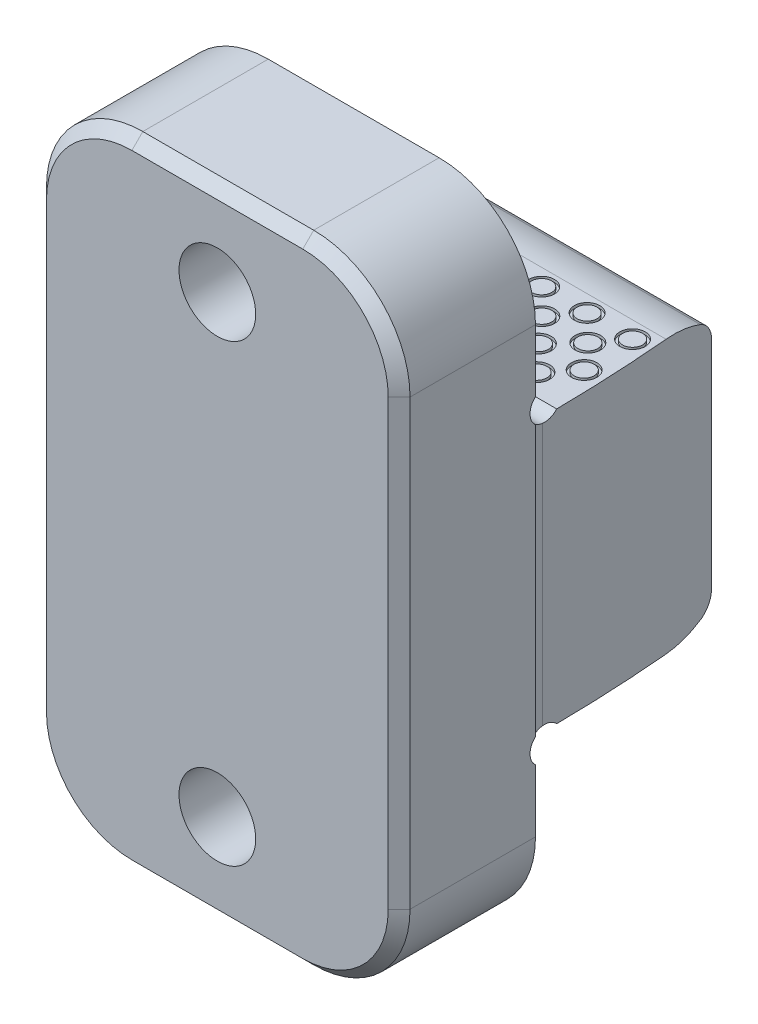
from build123d import *

# Parameters (mm, degrees)
EXTRUDE1_DEPTH             = 25.4
SKETCH7_W                  = 50.8
SKETCH7_H                  = 50.8
CUT_EXTRUDE3_DEPTH         = 0.254
SKETCH8_R                  = 2.286
CUT_EXTRUDE4_DEPTH         = 73.486188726
CUT_EXTRUDE5_DEPTH         = 73.486188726
CUT_EXTRUDE6_DEPTH         = 97.157033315
SKETCH15_R                 = 1.778
SKETCH15_R_2               = 1.397
CUT_EXTRUDE7_DEPTH         = 0.381
F_3_8_16_CBORE_D           = 9.525
F_3_8_16_CBORE_CBORE_D     = 15.875
F_3_8_16_CBORE_CBORE_DEPTH = 10.32002
F_1_2_13_TAPPED_HOLE1_D    = 10.71626
FILLET1_R                  = 13.462
CHAMFER1_SIZE              = 1.524


with BuildPart() as part:
    # Sketch3 → Extrude1 (new, symmetric)
    with BuildSketch(Plane(origin=(0, 0, 0), x_dir=(0, 0, -1), z_dir=(1, 0, 0))):
        Polygon((-19.05, -44.45), (0, -44.45), (0, -19.04746), (26.416, -19.04746), (26.416, 19.04746), (0, 19.04746), (0, 44.45), (-19.05, 44.45), align=None)
    extrude(amount=EXTRUDE1_DEPTH, both=True)

    # Sketch7 → Cut-Extrude3 (cut)
    with BuildSketch(Plane(origin=(25.4, 0, 0), x_dir=(0, 0, -1), z_dir=(1, 0, 0))):
        with Locations((25.4, 0)):
            Rectangle(SKETCH7_W, SKETCH7_H)
    cut_extrude3 = extrude(amount=-CUT_EXTRUDE3_DEPTH, mode=Mode.SUBTRACT)

    # Mirror2: Cut-Extrude3 across plane
    add(cut_extrude3.mirror(Plane(origin=(0, 0, 0), x_dir=(0, 0, 1), z_dir=(1, 0, 0))), mode=Mode.SUBTRACT)

    # Sketch8 → Cut-Extrude4 (cut, through all)
    with BuildSketch(Plane(origin=(25.4, 0, 0), x_dir=(0, 0, -1), z_dir=(1, 0, 0))):
        with Locations((1.524, 20.57146)):
            Circle(SKETCH8_R)
        with Locations((1.524, -20.57146)):
            Circle(SKETCH8_R)
    extrude(amount=-CUT_EXTRUDE4_DEPTH, mode=Mode.SUBTRACT)

    # Sketch9 → Cut-Extrude5 (cut, through all)
    with BuildSketch(Plane(origin=(25.4, 0, 0), x_dir=(0, 0, -1), z_dir=(1, 0, 0))):
        with BuildLine():
            Line((26.416, 15.102173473), (32.004, 15.102173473))
            Line((32.004, 15.102173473), (32.004, 21.452173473))
            Line((32.004, 21.452173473), (19.304, 21.452173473))
            Line((19.304, 21.452173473), (19.304, 19.04746))
            ThreePointArc((19.304, 19.04746), (22.042076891, 18.748787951), (24.651368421, 17.866819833))
            ThreePointArc((24.651368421, 17.866819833), (25.937242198, 16.742081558), (26.416, 15.102173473))
        make_face()
        with BuildLine():
            Line((32.004, -15.102173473), (32.004, -21.452173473))
            Line((32.004, -21.452173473), (19.304, -21.452173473))
            Line((19.304, -21.452173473), (19.304, -19.04746))
            ThreePointArc((19.304, -19.04746), (22.042076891, -18.748787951), (24.651368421, -17.866819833))
            ThreePointArc((24.651368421, -17.866819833), (25.937242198, -16.742081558), (26.416, -15.102173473))
            Line((26.416, -15.102173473), (32.004, -15.102173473))
        make_face()
    extrude(amount=-CUT_EXTRUDE5_DEPTH, mode=Mode.SUBTRACT)

    # Sketch13 → Cut-Extrude6 (cut, through all)
    with BuildSketch(Plane(origin=(0, 44.45, 0), x_dir=(1, 0, 0), z_dir=(0, 1, 0))):
        with BuildLine():
            Line((22.650203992, 33.02), (35.350203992, 33.02))
            Line((35.350203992, 33.02), (35.350203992, 1.27))
            Line((35.350203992, 1.27), (25.146, 1.27))
            ThreePointArc((25.146, 1.27), (24.521090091, 17.193971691), (22.650203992, 33.02))
        make_face()
    extrude(amount=-CUT_EXTRUDE6_DEPTH, mode=Mode.SUBTRACT)

    # Sketch15 → Cut-Extrude7 (cut)
    # profile 1 of 30: a face of its own
    with BuildSketch(Plane(origin=(0, 19.04746, 0), x_dir=(1, 0, 0), z_dir=(0, 1, 0))):
        with Locations(Location((-16.1036, 16.9672, 0), (0, 0, 270))):
            Circle(SKETCH15_R)
        with Locations(Location((-16.1036, 16.9672, 0), (0, 0, 270))):
            Circle(SKETCH15_R_2, mode=Mode.SUBTRACT)
    # profile 2 of 30: a face of its own
    with BuildSketch(Plane(origin=(0, 19.04746, 0), x_dir=(1, 0, 0), z_dir=(0, 1, 0))):
        with Locations(Location((-9.7536, 16.9672, 0), (0, 0, 270))):
            Circle(SKETCH15_R)
        with Locations(Location((-9.7536, 16.9672, 0), (0, 0, 270))):
            Circle(SKETCH15_R_2, mode=Mode.SUBTRACT)
    # profile 3 of 30: a face of its own
    with BuildSketch(Plane(origin=(0, 19.04746, 0), x_dir=(1, 0, 0), z_dir=(0, 1, 0))):
        with Locations(Location((-22.4536, 16.9672, 0), (0, 0, 270))):
            Circle(SKETCH15_R)
        with Locations(Location((-22.4536, 16.9672, 0), (0, 0, 270))):
            Circle(SKETCH15_R_2, mode=Mode.SUBTRACT)
    # profile 4 of 30: a face of its own
    with BuildSketch(Plane(origin=(0, 19.04746, 0), x_dir=(1, 0, 0), z_dir=(0, 1, 0))):
        with Locations(Location((-3.4036, 16.9672, 0), (0, 0, 270))):
            Circle(SKETCH15_R)
        with Locations(Location((-3.4036, 16.9672, 0), (0, 0, 270))):
            Circle(SKETCH15_R_2, mode=Mode.SUBTRACT)
    # profile 5 of 30: a face of its own
    with BuildSketch(Plane(origin=(0, 19.04746, 0), x_dir=(1, 0, 0), z_dir=(0, 1, 0))):
        with Locations(Location((2.9464, 16.9672, 0), (0, 0, 270))):
            Circle(SKETCH15_R)
        with Locations(Location((2.9464, 16.9672, 0), (0, 0, 270))):
            Circle(SKETCH15_R_2, mode=Mode.SUBTRACT)
    # profile 6 of 30: a face of its own
    with BuildSketch(Plane(origin=(0, 19.04746, 0), x_dir=(1, 0, 0), z_dir=(0, 1, 0))):
        with Locations(Location((9.2964, 16.9672, 0), (0, 0, 270))):
            Circle(SKETCH15_R)
        with Locations(Location((9.2964, 16.9672, 0), (0, 0, 270))):
            Circle(SKETCH15_R_2, mode=Mode.SUBTRACT)
    # profile 7 of 30: a face of its own
    with BuildSketch(Plane(origin=(0, 19.04746, 0), x_dir=(1, 0, 0), z_dir=(0, 1, 0))):
        with Locations(Location((15.6464, 16.9672, 0), (0, 0, 270))):
            Circle(SKETCH15_R)
        with Locations(Location((15.6464, 16.9672, 0), (0, 0, 270))):
            Circle(SKETCH15_R_2, mode=Mode.SUBTRACT)
    # profile 8 of 30: a face of its own
    with BuildSketch(Plane(origin=(0, 19.04746, 0), x_dir=(1, 0, 0), z_dir=(0, 1, 0))):
        with Locations(Location((21.9964, 16.9672, 0), (0, 0, 270))):
            Circle(SKETCH15_R)
        with Locations(Location((21.9964, 16.9672, 0), (0, 0, 270))):
            Circle(SKETCH15_R_2, mode=Mode.SUBTRACT)
    # profile 9 of 30: a face of its own
    with BuildSketch(Plane(origin=(0, 19.04746, 0), x_dir=(1, 0, 0), z_dir=(0, 1, 0))):
        with Locations(Location((-12.827, 13.4112, 0), (0, 0, 270))):
            Circle(SKETCH15_R)
        with Locations(Location((-12.827, 13.4112, 0), (0, 0, 270))):
            Circle(SKETCH15_R_2, mode=Mode.SUBTRACT)
    # profile 10 of 30: a face of its own
    with BuildSketch(Plane(origin=(0, 19.04746, 0), x_dir=(1, 0, 0), z_dir=(0, 1, 0))):
        with Locations(Location((-6.4008, 13.4112, 0), (0, 0, 270))):
            Circle(SKETCH15_R)
        with Locations(Location((-6.4008, 13.4112, 0), (0, 0, 270))):
            Circle(SKETCH15_R_2, mode=Mode.SUBTRACT)
    # profile 11 of 30: a face of its own
    with BuildSketch(Plane(origin=(0, 19.04746, 0), x_dir=(1, 0, 0), z_dir=(0, 1, 0))):
        with Locations(Location((-19.2532, 13.4112, 0), (0, 0, 270))):
            Circle(SKETCH15_R)
        with Locations(Location((-19.2532, 13.4112, 0), (0, 0, 270))):
            Circle(SKETCH15_R_2, mode=Mode.SUBTRACT)
    # profile 12 of 30: a face of its own
    with BuildSketch(Plane(origin=(0, 19.04746, 0), x_dir=(1, 0, 0), z_dir=(0, 1, 0))):
        with Locations(Location((0.0254, 13.4112, 0), (0, 0, 270))):
            Circle(SKETCH15_R)
        with Locations(Location((0.0254, 13.4112, 0), (0, 0, 270))):
            Circle(SKETCH15_R_2, mode=Mode.SUBTRACT)
    # profile 13 of 30: a face of its own
    with BuildSketch(Plane(origin=(0, 19.04746, 0), x_dir=(1, 0, 0), z_dir=(0, 1, 0))):
        with Locations(Location((6.4516, 13.4112, 0), (0, 0, 270))):
            Circle(SKETCH15_R)
        with Locations(Location((6.4516, 13.4112, 0), (0, 0, 270))):
            Circle(SKETCH15_R_2, mode=Mode.SUBTRACT)
    # profile 14 of 30: a face of its own
    with BuildSketch(Plane(origin=(0, 19.04746, 0), x_dir=(1, 0, 0), z_dir=(0, 1, 0))):
        with Locations(Location((12.8778, 13.4112, 0), (0, 0, 270))):
            Circle(SKETCH15_R)
        with Locations(Location((12.8778, 13.4112, 0), (0, 0, 270))):
            Circle(SKETCH15_R_2, mode=Mode.SUBTRACT)
    # profile 15 of 30: a face of its own
    with BuildSketch(Plane(origin=(0, 19.04746, 0), x_dir=(1, 0, 0), z_dir=(0, 1, 0))):
        with Locations(Location((19.304, 13.4112, 0), (0, 0, 270))):
            Circle(SKETCH15_R)
        with Locations(Location((19.304, 13.4112, 0), (0, 0, 270))):
            Circle(SKETCH15_R_2, mode=Mode.SUBTRACT)
    # profile 16 of 30: a face of its own
    with BuildSketch(Plane(origin=(0, 19.04746, 0), x_dir=(1, 0, 0), z_dir=(0, 1, 0))):
        with Locations(Location((-16.0528, 9.8552, 0), (0, 0, 270))):
            Circle(SKETCH15_R)
        with Locations(Location((-16.0528, 9.8552, 0), (0, 0, 270))):
            Circle(SKETCH15_R_2, mode=Mode.SUBTRACT)
    # profile 17 of 30: a face of its own
    with BuildSketch(Plane(origin=(0, 19.04746, 0), x_dir=(1, 0, 0), z_dir=(0, 1, 0))):
        with Locations(Location((-9.652, 9.8552, 0), (0, 0, 270))):
            Circle(SKETCH15_R)
        with Locations(Location((-9.652, 9.8552, 0), (0, 0, 270))):
            Circle(SKETCH15_R_2, mode=Mode.SUBTRACT)
    # profile 18 of 30: a face of its own
    with BuildSketch(Plane(origin=(0, 19.04746, 0), x_dir=(1, 0, 0), z_dir=(0, 1, 0))):
        with Locations(Location((-22.4536, 9.8552, 0), (0, 0, 270))):
            Circle(SKETCH15_R)
        with Locations(Location((-22.4536, 9.8552, 0), (0, 0, 270))):
            Circle(SKETCH15_R_2, mode=Mode.SUBTRACT)
    # profile 19 of 30: a face of its own
    with BuildSketch(Plane(origin=(0, 19.04746, 0), x_dir=(1, 0, 0), z_dir=(0, 1, 0))):
        with Locations(Location((-3.2512, 9.8552, 0), (0, 0, 270))):
            Circle(SKETCH15_R)
        with Locations(Location((-3.2512, 9.8552, 0), (0, 0, 270))):
            Circle(SKETCH15_R_2, mode=Mode.SUBTRACT)
    # profile 20 of 30: a face of its own
    with BuildSketch(Plane(origin=(0, 19.04746, 0), x_dir=(1, 0, 0), z_dir=(0, 1, 0))):
        with Locations(Location((3.1496, 9.8552, 0), (0, 0, 270))):
            Circle(SKETCH15_R)
        with Locations(Location((3.1496, 9.8552, 0), (0, 0, 270))):
            Circle(SKETCH15_R_2, mode=Mode.SUBTRACT)
    # profile 21 of 30: a face of its own
    with BuildSketch(Plane(origin=(0, 19.04746, 0), x_dir=(1, 0, 0), z_dir=(0, 1, 0))):
        with Locations(Location((9.5504, 9.8552, 0), (0, 0, 270))):
            Circle(SKETCH15_R)
        with Locations(Location((9.5504, 9.8552, 0), (0, 0, 270))):
            Circle(SKETCH15_R_2, mode=Mode.SUBTRACT)
    # profile 22 of 30: a face of its own
    with BuildSketch(Plane(origin=(0, 19.04746, 0), x_dir=(1, 0, 0), z_dir=(0, 1, 0))):
        with Locations(Location((15.9512, 9.8552, 0), (0, 0, 270))):
            Circle(SKETCH15_R)
        with Locations(Location((15.9512, 9.8552, 0), (0, 0, 270))):
            Circle(SKETCH15_R_2, mode=Mode.SUBTRACT)
    # profile 23 of 30: a face of its own
    with BuildSketch(Plane(origin=(0, 19.04746, 0), x_dir=(1, 0, 0), z_dir=(0, 1, 0))):
        with Locations(Location((22.352, 9.8552, 0), (0, 0, 270))):
            Circle(SKETCH15_R)
        with Locations(Location((22.352, 9.8552, 0), (0, 0, 270))):
            Circle(SKETCH15_R_2, mode=Mode.SUBTRACT)
    # profile 24 of 30: a face of its own
    with BuildSketch(Plane(origin=(0, 19.04746, 0), x_dir=(1, 0, 0), z_dir=(0, 1, 0))):
        with Locations(Location((-12.827, 6.2992, 0), (0, 0, 270))):
            Circle(SKETCH15_R)
        with Locations(Location((-12.827, 6.2992, 0), (0, 0, 270))):
            Circle(SKETCH15_R_2, mode=Mode.SUBTRACT)
    # profile 25 of 30: a face of its own
    with BuildSketch(Plane(origin=(0, 19.04746, 0), x_dir=(1, 0, 0), z_dir=(0, 1, 0))):
        with Locations(Location((-6.4008, 6.2992, 0), (0, 0, 270))):
            Circle(SKETCH15_R)
        with Locations(Location((-6.4008, 6.2992, 0), (0, 0, 270))):
            Circle(SKETCH15_R_2, mode=Mode.SUBTRACT)
    # profile 26 of 30: a face of its own
    with BuildSketch(Plane(origin=(0, 19.04746, 0), x_dir=(1, 0, 0), z_dir=(0, 1, 0))):
        with Locations(Location((-19.2532, 6.2992, 0), (0, 0, 270))):
            Circle(SKETCH15_R)
        with Locations(Location((-19.2532, 6.2992, 0), (0, 0, 270))):
            Circle(SKETCH15_R_2, mode=Mode.SUBTRACT)
    # profile 27 of 30: a face of its own
    with BuildSketch(Plane(origin=(0, 19.04746, 0), x_dir=(1, 0, 0), z_dir=(0, 1, 0))):
        with Locations(Location((0.0254, 6.2992, 0), (0, 0, 270))):
            Circle(SKETCH15_R)
        with Locations(Location((0.0254, 6.2992, 0), (0, 0, 270))):
            Circle(SKETCH15_R_2, mode=Mode.SUBTRACT)
    # profile 28 of 30: a face of its own
    with BuildSketch(Plane(origin=(0, 19.04746, 0), x_dir=(1, 0, 0), z_dir=(0, 1, 0))):
        with Locations(Location((6.4516, 6.2992, 0), (0, 0, 270))):
            Circle(SKETCH15_R)
        with Locations(Location((6.4516, 6.2992, 0), (0, 0, 270))):
            Circle(SKETCH15_R_2, mode=Mode.SUBTRACT)
    # profile 29 of 30: a face of its own
    with BuildSketch(Plane(origin=(0, 19.04746, 0), x_dir=(1, 0, 0), z_dir=(0, 1, 0))):
        with Locations(Location((12.8778, 6.2992, 0), (0, 0, 270))):
            Circle(SKETCH15_R)
        with Locations(Location((12.8778, 6.2992, 0), (0, 0, 270))):
            Circle(SKETCH15_R_2, mode=Mode.SUBTRACT)
    # profile 30 of 30: a face of its own
    with BuildSketch(Plane(origin=(0, 19.04746, 0), x_dir=(1, 0, 0), z_dir=(0, 1, 0))):
        with Locations(Location((19.304, 6.2992, 0), (0, 0, 270))):
            Circle(SKETCH15_R)
        with Locations(Location((19.304, 6.2992, 0), (0, 0, 270))):
            Circle(SKETCH15_R_2, mode=Mode.SUBTRACT)
    cut_extrude7 = extrude(amount=-CUT_EXTRUDE7_DEPTH, mode=Mode.SUBTRACT)

    # Mirror1: Cut-Extrude7 across plane
    add(cut_extrude7.mirror(Plane.ZX), mode=Mode.SUBTRACT)

    # 3_8_-16 CBORE (through all)
    with Locations(Plane(origin=(0, 0, 0), x_dir=(-1, 0, 0), z_dir=(0, 0, -1))):
        with Locations((0, 31.75), (0, -31.75)):
            CounterBoreHole(F_3_8_16_CBORE_D / 2, F_3_8_16_CBORE_CBORE_D / 2, F_3_8_16_CBORE_CBORE_DEPTH)

    # 1_2-13 Tapped Hole1 (through all)
    with Locations(Plane(origin=(0, 0, 10.32002), x_dir=(-1, 0, 0), z_dir=(0, 0, -1))):
        with Locations((0, -31.75), (0, 31.75)):
            Hole(F_1_2_13_TAPPED_HOLE1_D / 2)

    # Fillet1
    fillet1_edges = [part.edges().sort_by_distance(p)[0] for p in [
        (-25.4, -44.45, 9.525),
        (25.4, 44.45, 9.525),
        (25.4, -44.45, 9.525),
        (-25.4, 44.45, 9.525),
    ]]
    fillet(fillet1_edges, radius=FILLET1_R)

    # Chamfer1
    chamfer1_edges = [part.edges().sort_by_distance(p)[0] for p in [
        (25.4, 0, 19.05),
        (0, -44.45, 19.05),
        (-25.4, 0, 19.05),
        (0, 44.45, 19.05),
        (-21.457071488, -40.507071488, 19.05),
        (-21.457071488, 40.507071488, 19.05),
        (21.457071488, 40.507071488, 19.05),
        (21.457071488, -40.507071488, 19.05),
    ]]
    chamfer(chamfer1_edges, length=CHAMFER1_SIZE)


solid = part.part
